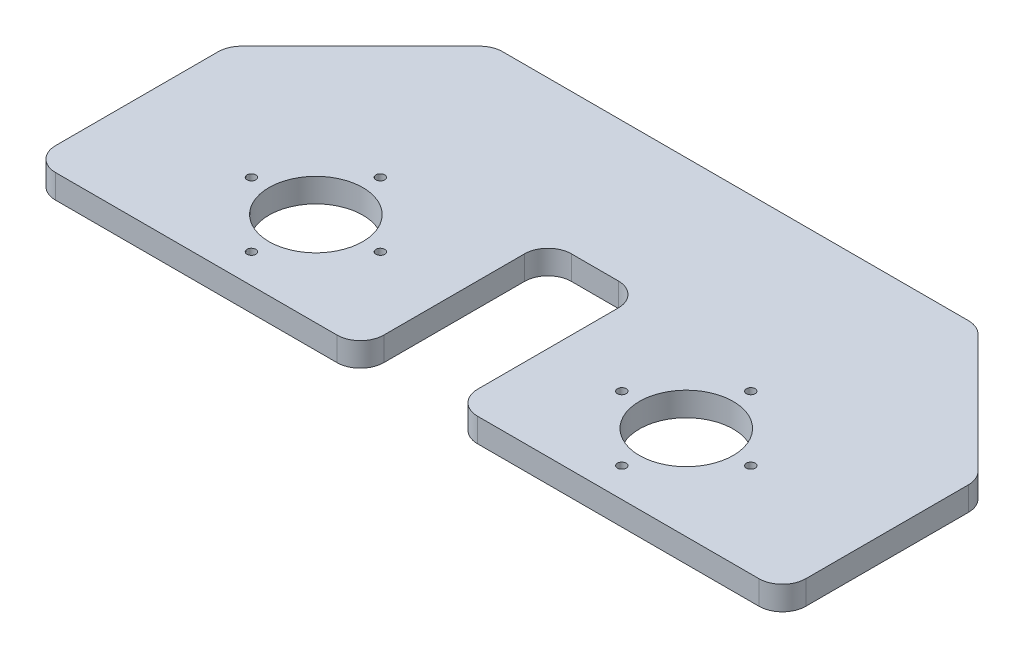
ISO-10303-21;
HEADER;
FILE_DESCRIPTION(('STEP AP214'),'2;1');
FILE_NAME('part.step','',(''),(''),'','','');
FILE_SCHEMA(('AUTOMOTIVE_DESIGN { 1 0 10303 214 1 1 1 1 }'));
ENDSEC;
DATA;
#1=APPLICATION_CONTEXT('core data for automotive mechanical design processes');
#2=APPLICATION_PROTOCOL_DEFINITION('international standard','automotive_design',2000,#1);
#3=PRODUCT_CONTEXT('',#1,'mechanical');
#4=PRODUCT('Part','Part','',(#3));
#5=PRODUCT_RELATED_PRODUCT_CATEGORY('part','',(#4));
#6=PRODUCT_DEFINITION_FORMATION('','',#4);
#7=PRODUCT_DEFINITION_CONTEXT('part definition',#1,'design');
#8=PRODUCT_DEFINITION('design','',#6,#7);
#9=PRODUCT_DEFINITION_SHAPE('','',#8);
#10=(LENGTH_UNIT() NAMED_UNIT(*) SI_UNIT(.MILLI.,.METRE.));
#11=(NAMED_UNIT(*) PLANE_ANGLE_UNIT() SI_UNIT($,.RADIAN.));
#12=(NAMED_UNIT(*) SI_UNIT($,.STERADIAN.) SOLID_ANGLE_UNIT());
#13=UNCERTAINTY_MEASURE_WITH_UNIT(LENGTH_MEASURE(1.E-05),#10,'distance_accuracy_value','');
#14=(GEOMETRIC_REPRESENTATION_CONTEXT(3) GLOBAL_UNCERTAINTY_ASSIGNED_CONTEXT((#13)) GLOBAL_UNIT_ASSIGNED_CONTEXT((#10,
#11,#12)) REPRESENTATION_CONTEXT('',''));
#15=CARTESIAN_POINT('',(0.,0.,0.));
#16=DIRECTION('',(0.,0.,1.));
#17=DIRECTION('',(1.,0.,0.));
#18=AXIS2_PLACEMENT_3D('',#15,#16,#17);
#19=CARTESIAN_POINT('',(-203.2,-12.954,50.8));
#20=DIRECTION('',(-1.,0.,0.));
#21=DIRECTION('',(0.,0.,1.));
#22=AXIS2_PLACEMENT_3D('',#19,#20,#21);
#23=PLANE('',#22);
#24=DIRECTION('',(0.,0.,1.));
#25=VECTOR('',#24,1.);
#26=CARTESIAN_POINT('',(-203.2,0.,50.8));
#27=LINE('',#26,#25);
#28=CARTESIAN_POINT('',(-203.2,0.,-49.8974387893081));
#29=VERTEX_POINT('',#28);
#30=CARTESIAN_POINT('',(-203.2,0.,38.1));
#31=VERTEX_POINT('',#30);
#32=EDGE_CURVE('E332',#29,#31,#27,.T.);
#33=ORIENTED_EDGE('',*,*,#32,.F.);
#34=DIRECTION('',(0.,1.,0.));
#35=VECTOR('',#34,1.);
#36=CARTESIAN_POINT('',(-203.2,-12.954,-49.8974387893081));
#37=LINE('',#36,#35);
#38=CARTESIAN_POINT('',(-203.2,-12.954,-49.8974387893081));
#39=VERTEX_POINT('',#38);
#40=EDGE_CURVE('E283',#29,#39,#37,.F.);
#41=ORIENTED_EDGE('',*,*,#40,.T.);
#42=DIRECTION('',(0.,0.,1.));
#43=VECTOR('',#42,1.);
#44=CARTESIAN_POINT('',(-203.2,-12.954,50.8));
#45=LINE('',#44,#43);
#46=CARTESIAN_POINT('',(-203.2,-12.954,38.1));
#47=VERTEX_POINT('',#46);
#48=EDGE_CURVE('E349',#39,#47,#45,.T.);
#49=ORIENTED_EDGE('',*,*,#48,.T.);
#50=DIRECTION('',(0.,1.,0.));
#51=VECTOR('',#50,1.);
#52=CARTESIAN_POINT('',(-203.2,-12.954,38.1));
#53=LINE('',#52,#51);
#54=EDGE_CURVE('E280',#47,#31,#53,.T.);
#55=ORIENTED_EDGE('',*,*,#54,.T.);
#56=EDGE_LOOP('',(#33,#41,#49,#55));
#57=FACE_BOUND('',#56,.T.);
#58=ADVANCED_FACE('F44',(#57),#23,.T.);
#59=CARTESIAN_POINT('',(-131.357951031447,-12.954,-127.));
#60=DIRECTION('',(-0.707106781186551,0.,-0.707106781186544));
#61=DIRECTION('',(-0.707106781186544,0.,0.707106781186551));
#62=AXIS2_PLACEMENT_3D('',#59,#60,#61);
#63=PLANE('',#62);
#64=DIRECTION('',(-0.707106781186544,0.,0.707106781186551));
#65=VECTOR('',#64,1.);
#66=CARTESIAN_POINT('',(-131.357951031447,0.,-127.));
#67=LINE('',#66,#65);
#68=CARTESIAN_POINT('',(-135.077694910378,0.,-123.280256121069));
#69=VERTEX_POINT('',#68);
#70=CARTESIAN_POINT('',(-199.480256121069,0.,-58.8776949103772));
#71=VERTEX_POINT('',#70);
#72=EDGE_CURVE('E213',#69,#71,#67,.T.);
#73=ORIENTED_EDGE('',*,*,#72,.F.);
#74=DIRECTION('',(0.,1.,0.));
#75=VECTOR('',#74,1.);
#76=CARTESIAN_POINT('',(-135.077694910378,-12.954,-123.280256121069));
#77=LINE('',#76,#75);
#78=CARTESIAN_POINT('',(-135.077694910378,-12.954,-123.280256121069));
#79=VERTEX_POINT('',#78);
#80=EDGE_CURVE('E278',#69,#79,#77,.F.);
#81=ORIENTED_EDGE('',*,*,#80,.T.);
#82=DIRECTION('',(-0.707106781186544,0.,0.707106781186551));
#83=VECTOR('',#82,1.);
#84=CARTESIAN_POINT('',(-131.357951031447,-12.954,-127.));
#85=LINE('',#84,#83);
#86=CARTESIAN_POINT('',(-199.480256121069,-12.954,-58.8776949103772));
#87=VERTEX_POINT('',#86);
#88=EDGE_CURVE('E205',#79,#87,#85,.T.);
#89=ORIENTED_EDGE('',*,*,#88,.T.);
#90=DIRECTION('',(0.,1.,0.));
#91=VECTOR('',#90,1.);
#92=CARTESIAN_POINT('',(-199.480256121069,-12.954,-58.8776949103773));
#93=LINE('',#92,#91);
#94=EDGE_CURVE('E275',#87,#71,#93,.T.);
#95=ORIENTED_EDGE('',*,*,#94,.T.);
#96=EDGE_LOOP('',(#73,#81,#89,#95));
#97=FACE_BOUND('',#96,.T.);
#98=ADVANCED_FACE('F461',(#97),#63,.T.);
#99=CARTESIAN_POINT('',(-131.357951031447,-12.954,-127.));
#100=DIRECTION('',(0.,0.,-1.));
#101=DIRECTION('',(-1.,0.,0.));
#102=AXIS2_PLACEMENT_3D('',#99,#100,#101);
#103=PLANE('',#102);
#104=DIRECTION('',(-1.,0.,0.));
#105=VECTOR('',#104,1.);
#106=CARTESIAN_POINT('',(-131.357951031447,0.,-127.));
#107=LINE('',#106,#105);
#108=CARTESIAN_POINT('',(126.097438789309,0.,-127.));
#109=VERTEX_POINT('',#108);
#110=CARTESIAN_POINT('',(-126.097438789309,0.,-127.));
#111=VERTEX_POINT('',#110);
#112=EDGE_CURVE('E345',#109,#111,#107,.T.);
#113=ORIENTED_EDGE('',*,*,#112,.F.);
#114=DIRECTION('',(0.,1.,0.));
#115=VECTOR('',#114,1.);
#116=CARTESIAN_POINT('',(126.097438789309,-12.954,-127.));
#117=LINE('',#116,#115);
#118=CARTESIAN_POINT('',(126.097438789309,-12.954,-127.));
#119=VERTEX_POINT('',#118);
#120=EDGE_CURVE('E273',#109,#119,#117,.F.);
#121=ORIENTED_EDGE('',*,*,#120,.T.);
#122=DIRECTION('',(-1.,0.,0.));
#123=VECTOR('',#122,1.);
#124=CARTESIAN_POINT('',(-131.357951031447,-12.954,-127.));
#125=LINE('',#124,#123);
#126=CARTESIAN_POINT('',(-126.097438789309,-12.954,-127.));
#127=VERTEX_POINT('',#126);
#128=EDGE_CURVE('E210',#119,#127,#125,.T.);
#129=ORIENTED_EDGE('',*,*,#128,.T.);
#130=DIRECTION('',(0.,1.,0.));
#131=VECTOR('',#130,1.);
#132=CARTESIAN_POINT('',(-126.097438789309,-12.954,-127.));
#133=LINE('',#132,#131);
#134=EDGE_CURVE('E270',#127,#111,#133,.T.);
#135=ORIENTED_EDGE('',*,*,#134,.T.);
#136=EDGE_LOOP('',(#113,#121,#129,#135));
#137=FACE_BOUND('',#136,.T.);
#138=ADVANCED_FACE('F466',(#137),#103,.T.);
#139=CARTESIAN_POINT('',(131.357951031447,-12.954,-127.));
#140=DIRECTION('',(0.707106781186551,0.,-0.707106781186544));
#141=DIRECTION('',(-0.707106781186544,0.,-0.707106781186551));
#142=AXIS2_PLACEMENT_3D('',#139,#140,#141);
#143=PLANE('',#142);
#144=DIRECTION('',(-0.707106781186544,0.,-0.707106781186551));
#145=VECTOR('',#144,1.);
#146=CARTESIAN_POINT('',(131.357951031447,0.,-127.));
#147=LINE('',#146,#145);
#148=CARTESIAN_POINT('',(199.480256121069,0.,-58.8776949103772));
#149=VERTEX_POINT('',#148);
#150=CARTESIAN_POINT('',(135.077694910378,0.,-123.280256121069));
#151=VERTEX_POINT('',#150);
#152=EDGE_CURVE('E343',#149,#151,#147,.T.);
#153=ORIENTED_EDGE('',*,*,#152,.F.);
#154=DIRECTION('',(0.,1.,0.));
#155=VECTOR('',#154,1.);
#156=CARTESIAN_POINT('',(199.480256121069,-12.954,-58.8776949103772));
#157=LINE('',#156,#155);
#158=CARTESIAN_POINT('',(199.480256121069,-12.954,-58.8776949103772));
#159=VERTEX_POINT('',#158);
#160=EDGE_CURVE('E268',#149,#159,#157,.F.);
#161=ORIENTED_EDGE('',*,*,#160,.T.);
#162=DIRECTION('',(-0.707106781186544,0.,-0.707106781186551));
#163=VECTOR('',#162,1.);
#164=CARTESIAN_POINT('',(131.357951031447,-12.954,-127.));
#165=LINE('',#164,#163);
#166=CARTESIAN_POINT('',(135.077694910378,-12.954,-123.280256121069));
#167=VERTEX_POINT('',#166);
#168=EDGE_CURVE('E327',#159,#167,#165,.T.);
#169=ORIENTED_EDGE('',*,*,#168,.T.);
#170=DIRECTION('',(0.,1.,0.));
#171=VECTOR('',#170,1.);
#172=CARTESIAN_POINT('',(135.077694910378,-12.954,-123.280256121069));
#173=LINE('',#172,#171);
#174=EDGE_CURVE('E265',#167,#151,#173,.T.);
#175=ORIENTED_EDGE('',*,*,#174,.T.);
#176=EDGE_LOOP('',(#153,#161,#169,#175));
#177=FACE_BOUND('',#176,.T.);
#178=ADVANCED_FACE('F524',(#177),#143,.T.);
#179=CARTESIAN_POINT('',(203.2,-12.954,50.8));
#180=DIRECTION('',(1.,0.,0.));
#181=DIRECTION('',(0.,0.,-1.));
#182=AXIS2_PLACEMENT_3D('',#179,#180,#181);
#183=PLANE('',#182);
#184=DIRECTION('',(0.,0.,-1.));
#185=VECTOR('',#184,1.);
#186=CARTESIAN_POINT('',(203.2,0.,50.8));
#187=LINE('',#186,#185);
#188=CARTESIAN_POINT('',(203.2,0.,38.1));
#189=VERTEX_POINT('',#188);
#190=CARTESIAN_POINT('',(203.2,0.,-49.8974387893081));
#191=VERTEX_POINT('',#190);
#192=EDGE_CURVE('E340',#189,#191,#187,.T.);
#193=ORIENTED_EDGE('',*,*,#192,.F.);
#194=DIRECTION('',(0.,1.,0.));
#195=VECTOR('',#194,1.);
#196=CARTESIAN_POINT('',(203.2,-12.954,38.1));
#197=LINE('',#196,#195);
#198=CARTESIAN_POINT('',(203.2,-12.954,38.1));
#199=VERTEX_POINT('',#198);
#200=EDGE_CURVE('E263',#189,#199,#197,.F.);
#201=ORIENTED_EDGE('',*,*,#200,.T.);
#202=DIRECTION('',(0.,0.,-1.));
#203=VECTOR('',#202,1.);
#204=CARTESIAN_POINT('',(203.2,-12.954,50.8));
#205=LINE('',#204,#203);
#206=CARTESIAN_POINT('',(203.2,-12.954,-49.8974387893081));
#207=VERTEX_POINT('',#206);
#208=EDGE_CURVE('E324',#199,#207,#205,.T.);
#209=ORIENTED_EDGE('',*,*,#208,.T.);
#210=DIRECTION('',(0.,1.,0.));
#211=VECTOR('',#210,1.);
#212=CARTESIAN_POINT('',(203.2,-12.954,-49.8974387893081));
#213=LINE('',#212,#211);
#214=EDGE_CURVE('E260',#207,#191,#213,.T.);
#215=ORIENTED_EDGE('',*,*,#214,.T.);
#216=EDGE_LOOP('',(#193,#201,#209,#215));
#217=FACE_BOUND('',#216,.T.);
#218=ADVANCED_FACE('F531',(#217),#183,.T.);
#219=CARTESIAN_POINT('',(25.4,-12.954,50.8));
#220=DIRECTION('',(0.,0.,1.));
#221=DIRECTION('',(1.,0.,0.));
#222=AXIS2_PLACEMENT_3D('',#219,#220,#221);
#223=PLANE('',#222);
#224=DIRECTION('',(1.,0.,0.));
#225=VECTOR('',#224,1.);
#226=CARTESIAN_POINT('',(25.4,0.,50.8));
#227=LINE('',#226,#225);
#228=CARTESIAN_POINT('',(38.1,0.,50.8));
#229=VERTEX_POINT('',#228);
#230=CARTESIAN_POINT('',(190.5,0.,50.8));
#231=VERTEX_POINT('',#230);
#232=EDGE_CURVE('E300',#229,#231,#227,.T.);
#233=ORIENTED_EDGE('',*,*,#232,.F.);
#234=DIRECTION('',(0.,1.,0.));
#235=VECTOR('',#234,1.);
#236=CARTESIAN_POINT('',(38.1,-12.954,50.8));
#237=LINE('',#236,#235);
#238=CARTESIAN_POINT('',(38.1,-12.954,50.8));
#239=VERTEX_POINT('',#238);
#240=EDGE_CURVE('E240',#229,#239,#237,.F.);
#241=ORIENTED_EDGE('',*,*,#240,.T.);
#242=DIRECTION('',(1.,0.,0.));
#243=VECTOR('',#242,1.);
#244=CARTESIAN_POINT('',(25.4,-12.954,50.8));
#245=LINE('',#244,#243);
#246=CARTESIAN_POINT('',(190.5,-12.954,50.8));
#247=VERTEX_POINT('',#246);
#248=EDGE_CURVE('E316',#239,#247,#245,.T.);
#249=ORIENTED_EDGE('',*,*,#248,.T.);
#250=DIRECTION('',(0.,1.,0.));
#251=VECTOR('',#250,1.);
#252=CARTESIAN_POINT('',(190.5,-12.954,50.8));
#253=LINE('',#252,#251);
#254=EDGE_CURVE('E237',#247,#231,#253,.T.);
#255=ORIENTED_EDGE('',*,*,#254,.T.);
#256=EDGE_LOOP('',(#233,#241,#249,#255));
#257=FACE_BOUND('',#256,.T.);
#258=ADVANCED_FACE('F537',(#257),#223,.T.);
#259=CARTESIAN_POINT('',(25.4,-12.954,50.8));
#260=DIRECTION('',(-1.,0.,0.));
#261=DIRECTION('',(0.,0.,1.));
#262=AXIS2_PLACEMENT_3D('',#259,#260,#261);
#263=PLANE('',#262);
#264=DIRECTION('',(0.,0.,1.));
#265=VECTOR('',#264,1.);
#266=CARTESIAN_POINT('',(25.4,0.,50.8));
#267=LINE('',#266,#265);
#268=CARTESIAN_POINT('',(25.4,0.,-38.1));
#269=VERTEX_POINT('',#268);
#270=CARTESIAN_POINT('',(25.4,0.,38.1));
#271=VERTEX_POINT('',#270);
#272=EDGE_CURVE('E290',#269,#271,#267,.T.);
#273=ORIENTED_EDGE('',*,*,#272,.F.);
#274=DIRECTION('',(0.,1.,0.));
#275=VECTOR('',#274,1.);
#276=CARTESIAN_POINT('',(25.4,-12.954,-38.1));
#277=LINE('',#276,#275);
#278=CARTESIAN_POINT('',(25.4,-12.954,-38.1));
#279=VERTEX_POINT('',#278);
#280=EDGE_CURVE('E223',#269,#279,#277,.F.);
#281=ORIENTED_EDGE('',*,*,#280,.T.);
#282=DIRECTION('',(0.,0.,1.));
#283=VECTOR('',#282,1.);
#284=CARTESIAN_POINT('',(25.4,-12.954,50.8));
#285=LINE('',#284,#283);
#286=CARTESIAN_POINT('',(25.4,-12.954,38.1));
#287=VERTEX_POINT('',#286);
#288=EDGE_CURVE('E310',#279,#287,#285,.T.);
#289=ORIENTED_EDGE('',*,*,#288,.T.);
#290=DIRECTION('',(0.,1.,0.));
#291=VECTOR('',#290,1.);
#292=CARTESIAN_POINT('',(25.4,-12.954,38.1));
#293=LINE('',#292,#291);
#294=EDGE_CURVE('E220',#287,#271,#293,.T.);
#295=ORIENTED_EDGE('',*,*,#294,.T.);
#296=EDGE_LOOP('',(#273,#281,#289,#295));
#297=FACE_BOUND('',#296,.T.);
#298=ADVANCED_FACE('F296',(#297),#263,.T.);
#299=CARTESIAN_POINT('',(-25.4,-12.954,-50.8));
#300=DIRECTION('',(0.,0.,1.));
#301=DIRECTION('',(1.,0.,0.));
#302=AXIS2_PLACEMENT_3D('',#299,#300,#301);
#303=PLANE('',#302);
#304=DIRECTION('',(1.,0.,0.));
#305=VECTOR('',#304,1.);
#306=CARTESIAN_POINT('',(-25.4,0.,-50.8));
#307=LINE('',#306,#305);
#308=CARTESIAN_POINT('',(-12.7,0.,-50.8));
#309=VERTEX_POINT('',#308);
#310=CARTESIAN_POINT('',(12.7,0.,-50.8));
#311=VERTEX_POINT('',#310);
#312=EDGE_CURVE('E202',#309,#311,#307,.T.);
#313=ORIENTED_EDGE('',*,*,#312,.F.);
#314=DIRECTION('',(0.,1.,0.));
#315=VECTOR('',#314,1.);
#316=CARTESIAN_POINT('',(-12.7,-12.954,-50.8));
#317=LINE('',#316,#315);
#318=CARTESIAN_POINT('',(-12.7,-12.954,-50.8));
#319=VERTEX_POINT('',#318);
#320=EDGE_CURVE('E218',#309,#319,#317,.F.);
#321=ORIENTED_EDGE('',*,*,#320,.T.);
#322=DIRECTION('',(1.,0.,0.));
#323=VECTOR('',#322,1.);
#324=CARTESIAN_POINT('',(-25.4,-12.954,-50.8));
#325=LINE('',#324,#323);
#326=CARTESIAN_POINT('',(12.7,-12.954,-50.8));
#327=VERTEX_POINT('',#326);
#328=EDGE_CURVE('E308',#319,#327,#325,.T.);
#329=ORIENTED_EDGE('',*,*,#328,.T.);
#330=DIRECTION('',(0.,1.,0.));
#331=VECTOR('',#330,1.);
#332=CARTESIAN_POINT('',(12.7,0.,-50.8));
#333=LINE('',#332,#331);
#334=EDGE_CURVE('E207',#327,#311,#333,.T.);
#335=ORIENTED_EDGE('',*,*,#334,.T.);
#336=EDGE_LOOP('',(#313,#321,#329,#335));
#337=FACE_BOUND('',#336,.T.);
#338=ADVANCED_FACE('F312',(#337),#303,.T.);
#339=CARTESIAN_POINT('',(-25.4,-12.954,50.8));
#340=DIRECTION('',(1.,0.,0.));
#341=DIRECTION('',(0.,0.,-1.));
#342=AXIS2_PLACEMENT_3D('',#339,#340,#341);
#343=PLANE('',#342);
#344=DIRECTION('',(0.,0.,-1.));
#345=VECTOR('',#344,1.);
#346=CARTESIAN_POINT('',(-25.4,-12.954,50.8));
#347=LINE('',#346,#345);
#348=CARTESIAN_POINT('',(-25.4,-12.954,38.1));
#349=VERTEX_POINT('',#348);
#350=CARTESIAN_POINT('',(-25.4,-12.954,-38.1));
#351=VERTEX_POINT('',#350);
#352=EDGE_CURVE('E314',#349,#351,#347,.T.);
#353=ORIENTED_EDGE('',*,*,#352,.T.);
#354=DIRECTION('',(0.,1.,0.));
#355=VECTOR('',#354,1.);
#356=CARTESIAN_POINT('',(-25.4,0.,-38.1));
#357=LINE('',#356,#355);
#358=CARTESIAN_POINT('',(-25.4,0.,-38.1));
#359=VERTEX_POINT('',#358);
#360=EDGE_CURVE('E201',#351,#359,#357,.T.);
#361=ORIENTED_EDGE('',*,*,#360,.T.);
#362=DIRECTION('',(0.,0.,-1.));
#363=VECTOR('',#362,1.);
#364=CARTESIAN_POINT('',(-25.4,0.,50.8));
#365=LINE('',#364,#363);
#366=CARTESIAN_POINT('',(-25.4,0.,38.1));
#367=VERTEX_POINT('',#366);
#368=EDGE_CURVE('E186',#367,#359,#365,.T.);
#369=ORIENTED_EDGE('',*,*,#368,.F.);
#370=DIRECTION('',(0.,1.,0.));
#371=VECTOR('',#370,1.);
#372=CARTESIAN_POINT('',(-25.4,-12.954,38.1));
#373=LINE('',#372,#371);
#374=EDGE_CURVE('E199',#367,#349,#373,.F.);
#375=ORIENTED_EDGE('',*,*,#374,.T.);
#376=EDGE_LOOP('',(#353,#361,#369,#375));
#377=FACE_BOUND('',#376,.T.);
#378=ADVANCED_FACE('F198',(#377),#343,.T.);
#379=CARTESIAN_POINT('',(-203.2,-12.954,50.8));
#380=DIRECTION('',(0.,0.,1.));
#381=DIRECTION('',(1.,0.,0.));
#382=AXIS2_PLACEMENT_3D('',#379,#380,#381);
#383=PLANE('',#382);
#384=DIRECTION('',(1.,0.,0.));
#385=VECTOR('',#384,1.);
#386=CARTESIAN_POINT('',(-203.2,-12.954,50.8));
#387=LINE('',#386,#385);
#388=CARTESIAN_POINT('',(-190.5,-12.954,50.8));
#389=VERTEX_POINT('',#388);
#390=CARTESIAN_POINT('',(-38.1,-12.954,50.8));
#391=VERTEX_POINT('',#390);
#392=EDGE_CURVE('E318',#389,#391,#387,.T.);
#393=ORIENTED_EDGE('',*,*,#392,.T.);
#394=DIRECTION('',(0.,1.,0.));
#395=VECTOR('',#394,1.);
#396=CARTESIAN_POINT('',(-38.1,-12.954,50.8));
#397=LINE('',#396,#395);
#398=CARTESIAN_POINT('',(-38.1,0.,50.8));
#399=VERTEX_POINT('',#398);
#400=EDGE_CURVE('E258',#391,#399,#397,.T.);
#401=ORIENTED_EDGE('',*,*,#400,.T.);
#402=DIRECTION('',(1.,0.,0.));
#403=VECTOR('',#402,1.);
#404=CARTESIAN_POINT('',(-203.2,0.,50.8));
#405=LINE('',#404,#403);
#406=CARTESIAN_POINT('',(-190.5,0.,50.8));
#407=VERTEX_POINT('',#406);
#408=EDGE_CURVE('E187',#407,#399,#405,.T.);
#409=ORIENTED_EDGE('',*,*,#408,.F.);
#410=DIRECTION('',(0.,1.,0.));
#411=VECTOR('',#410,1.);
#412=CARTESIAN_POINT('',(-190.5,-12.954,50.8));
#413=LINE('',#412,#411);
#414=EDGE_CURVE('E66',#407,#389,#413,.F.);
#415=ORIENTED_EDGE('',*,*,#414,.T.);
#416=EDGE_LOOP('',(#393,#401,#409,#415));
#417=FACE_BOUND('',#416,.T.);
#418=ADVANCED_FACE('F472',(#417),#383,.T.);
#419=CARTESIAN_POINT('',(0.,-12.954,0.));
#420=DIRECTION('',(0.,-1.,0.));
#421=DIRECTION('',(0.,0.,-1.));
#422=AXIS2_PLACEMENT_3D('',#419,#420,#421);
#423=PLANE('',#422);
#424=CARTESIAN_POINT('',(100.33,-12.954,0.));
#425=DIRECTION('',(0.,1.,0.));
#426=DIRECTION('',(0.,0.,1.));
#427=AXIS2_PLACEMENT_3D('',#424,#425,#426);
#428=CIRCLE('',#427,25.4);
#429=CARTESIAN_POINT('',(100.33,-12.954,25.4));
#430=VERTEX_POINT('',#429);
#431=EDGE_CURVE('E360',#430,#430,#428,.T.);
#432=ORIENTED_EDGE('',*,*,#431,.T.);
#433=EDGE_LOOP('',(#432));
#434=FACE_BOUND('',#433,.T.);
#435=CARTESIAN_POINT('',(-100.33,-12.954,0.));
#436=DIRECTION('',(0.,1.,0.));
#437=DIRECTION('',(0.,0.,1.));
#438=AXIS2_PLACEMENT_3D('',#435,#436,#437);
#439=CIRCLE('',#438,25.4);
#440=CARTESIAN_POINT('',(-100.33,-12.954,25.4));
#441=VERTEX_POINT('',#440);
#442=EDGE_CURVE('E335',#441,#441,#439,.T.);
#443=ORIENTED_EDGE('',*,*,#442,.T.);
#444=EDGE_LOOP('',(#443));
#445=FACE_BOUND('',#444,.T.);
#446=ORIENTED_EDGE('',*,*,#248,.F.);
#447=CARTESIAN_POINT('',(38.1,-12.954,38.1));
#448=DIRECTION('',(0.,-1.,0.));
#449=DIRECTION('',(0.,0.,-1.));
#450=AXIS2_PLACEMENT_3D('',#447,#448,#449);
#451=CIRCLE('',#450,12.7);
#452=EDGE_CURVE('E255',#239,#287,#451,.T.);
#453=ORIENTED_EDGE('',*,*,#452,.T.);
#454=ORIENTED_EDGE('',*,*,#288,.F.);
#455=CARTESIAN_POINT('',(12.7,-12.954,-38.1));
#456=DIRECTION('',(0.,-1.,0.));
#457=DIRECTION('',(0.,0.,-1.));
#458=AXIS2_PLACEMENT_3D('',#455,#456,#457);
#459=CIRCLE('',#458,12.7);
#460=EDGE_CURVE('E13',#279,#327,#459,.F.);
#461=ORIENTED_EDGE('',*,*,#460,.T.);
#462=ORIENTED_EDGE('',*,*,#328,.F.);
#463=CARTESIAN_POINT('',(-12.7,-12.954,-38.1));
#464=DIRECTION('',(0.,-1.,0.));
#465=DIRECTION('',(0.,0.,-1.));
#466=AXIS2_PLACEMENT_3D('',#463,#464,#465);
#467=CIRCLE('',#466,12.7);
#468=EDGE_CURVE('E287',#319,#351,#467,.F.);
#469=ORIENTED_EDGE('',*,*,#468,.T.);
#470=ORIENTED_EDGE('',*,*,#352,.F.);
#471=CARTESIAN_POINT('',(-38.1,-12.954,38.1));
#472=DIRECTION('',(0.,-1.,0.));
#473=DIRECTION('',(0.,0.,-1.));
#474=AXIS2_PLACEMENT_3D('',#471,#472,#473);
#475=CIRCLE('',#474,12.7);
#476=EDGE_CURVE('E59',#349,#391,#475,.T.);
#477=ORIENTED_EDGE('',*,*,#476,.T.);
#478=ORIENTED_EDGE('',*,*,#392,.F.);
#479=CARTESIAN_POINT('',(-190.5,-12.954,38.1));
#480=DIRECTION('',(0.,-1.,0.));
#481=DIRECTION('',(0.,0.,-1.));
#482=AXIS2_PLACEMENT_3D('',#479,#480,#481);
#483=CIRCLE('',#482,12.7);
#484=EDGE_CURVE('E242',#389,#47,#483,.T.);
#485=ORIENTED_EDGE('',*,*,#484,.T.);
#486=ORIENTED_EDGE('',*,*,#48,.F.);
#487=CARTESIAN_POINT('',(-190.5,-12.954,-49.8974387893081));
#488=DIRECTION('',(0.,-1.,0.));
#489=DIRECTION('',(0.,0.,-1.));
#490=AXIS2_PLACEMENT_3D('',#487,#488,#489);
#491=CIRCLE('',#490,12.7);
#492=EDGE_CURVE('E244',#39,#87,#491,.T.);
#493=ORIENTED_EDGE('',*,*,#492,.T.);
#494=ORIENTED_EDGE('',*,*,#88,.F.);
#495=CARTESIAN_POINT('',(-126.097438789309,-12.954,-114.3));
#496=DIRECTION('',(0.,-1.,0.));
#497=DIRECTION('',(0.,0.,-1.));
#498=AXIS2_PLACEMENT_3D('',#495,#496,#497);
#499=CIRCLE('',#498,12.7);
#500=EDGE_CURVE('E246',#79,#127,#499,.T.);
#501=ORIENTED_EDGE('',*,*,#500,.T.);
#502=ORIENTED_EDGE('',*,*,#128,.F.);
#503=CARTESIAN_POINT('',(126.097438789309,-12.954,-114.3));
#504=DIRECTION('',(0.,-1.,0.));
#505=DIRECTION('',(0.,0.,-1.));
#506=AXIS2_PLACEMENT_3D('',#503,#504,#505);
#507=CIRCLE('',#506,12.7);
#508=EDGE_CURVE('E248',#119,#167,#507,.T.);
#509=ORIENTED_EDGE('',*,*,#508,.T.);
#510=ORIENTED_EDGE('',*,*,#168,.F.);
#511=CARTESIAN_POINT('',(190.5,-12.954,-49.8974387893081));
#512=DIRECTION('',(0.,-1.,0.));
#513=DIRECTION('',(0.,0.,-1.));
#514=AXIS2_PLACEMENT_3D('',#511,#512,#513);
#515=CIRCLE('',#514,12.7);
#516=EDGE_CURVE('E250',#159,#207,#515,.T.);
#517=ORIENTED_EDGE('',*,*,#516,.T.);
#518=ORIENTED_EDGE('',*,*,#208,.F.);
#519=CARTESIAN_POINT('',(190.5,-12.954,38.1));
#520=DIRECTION('',(0.,-1.,0.));
#521=DIRECTION('',(0.,0.,-1.));
#522=AXIS2_PLACEMENT_3D('',#519,#520,#521);
#523=CIRCLE('',#522,12.7);
#524=EDGE_CURVE('E252',#199,#247,#523,.T.);
#525=ORIENTED_EDGE('',*,*,#524,.T.);
#526=EDGE_LOOP('',(#446,#453,#454,#461,#462,#469,#470,#477,#478,#485,#486,#493,#494,#501,#502,
#509,#510,#517,#518,#525));
#527=FACE_BOUND('',#526,.T.);
#528=ADVANCED_FACE('F307',(#434,#445,#527),#423,.T.);
#529=CARTESIAN_POINT('',(0.,0.,0.));
#530=DIRECTION('',(0.,-1.,0.));
#531=DIRECTION('',(0.,0.,-1.));
#532=AXIS2_PLACEMENT_3D('',#529,#530,#531);
#533=PLANE('',#532);
#534=CARTESIAN_POINT('',(100.33,0.,34.925));
#535=DIRECTION('',(0.,1.,0.));
#536=DIRECTION('',(0.,0.,1.));
#537=AXIS2_PLACEMENT_3D('',#534,#535,#536);
#538=CIRCLE('',#537,2.37490000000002);
#539=CARTESIAN_POINT('',(100.33,0.,37.2999));
#540=VERTEX_POINT('',#539);
#541=EDGE_CURVE('E411',#540,#540,#538,.T.);
#542=ORIENTED_EDGE('',*,*,#541,.F.);
#543=EDGE_LOOP('',(#542));
#544=FACE_BOUND('',#543,.T.);
#545=CARTESIAN_POINT('',(135.255,0.,0.));
#546=DIRECTION('',(0.,1.,0.));
#547=DIRECTION('',(0.,0.,1.));
#548=AXIS2_PLACEMENT_3D('',#545,#546,#547);
#549=CIRCLE('',#548,2.37490000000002);
#550=CARTESIAN_POINT('',(135.255,0.,2.37490000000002));
#551=VERTEX_POINT('',#550);
#552=EDGE_CURVE('E405',#551,#551,#549,.T.);
#553=ORIENTED_EDGE('',*,*,#552,.F.);
#554=EDGE_LOOP('',(#553));
#555=FACE_BOUND('',#554,.T.);
#556=CARTESIAN_POINT('',(100.33,0.,-34.925));
#557=DIRECTION('',(0.,1.,0.));
#558=DIRECTION('',(0.,0.,1.));
#559=AXIS2_PLACEMENT_3D('',#556,#557,#558);
#560=CIRCLE('',#559,2.37490000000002);
#561=CARTESIAN_POINT('',(100.33,0.,-32.5501));
#562=VERTEX_POINT('',#561);
#563=EDGE_CURVE('E399',#562,#562,#560,.T.);
#564=ORIENTED_EDGE('',*,*,#563,.F.);
#565=EDGE_LOOP('',(#564));
#566=FACE_BOUND('',#565,.T.);
#567=CARTESIAN_POINT('',(65.405,0.,0.));
#568=DIRECTION('',(0.,1.,0.));
#569=DIRECTION('',(0.,0.,1.));
#570=AXIS2_PLACEMENT_3D('',#567,#568,#569);
#571=CIRCLE('',#570,2.37490000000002);
#572=CARTESIAN_POINT('',(65.405,0.,2.37490000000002));
#573=VERTEX_POINT('',#572);
#574=EDGE_CURVE('E393',#573,#573,#571,.T.);
#575=ORIENTED_EDGE('',*,*,#574,.F.);
#576=EDGE_LOOP('',(#575));
#577=FACE_BOUND('',#576,.T.);
#578=CARTESIAN_POINT('',(-135.255,0.,0.));
#579=DIRECTION('',(0.,1.,0.));
#580=DIRECTION('',(0.,0.,1.));
#581=AXIS2_PLACEMENT_3D('',#578,#579,#580);
#582=CIRCLE('',#581,2.37490000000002);
#583=CARTESIAN_POINT('',(-135.255,0.,2.37490000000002));
#584=VERTEX_POINT('',#583);
#585=EDGE_CURVE('E387',#584,#584,#582,.T.);
#586=ORIENTED_EDGE('',*,*,#585,.F.);
#587=EDGE_LOOP('',(#586));
#588=FACE_BOUND('',#587,.T.);
#589=CARTESIAN_POINT('',(-65.405,0.,0.));
#590=DIRECTION('',(0.,1.,0.));
#591=DIRECTION('',(0.,0.,1.));
#592=AXIS2_PLACEMENT_3D('',#589,#590,#591);
#593=CIRCLE('',#592,2.37490000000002);
#594=CARTESIAN_POINT('',(-65.405,0.,2.37490000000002));
#595=VERTEX_POINT('',#594);
#596=EDGE_CURVE('E381',#595,#595,#593,.T.);
#597=ORIENTED_EDGE('',*,*,#596,.F.);
#598=EDGE_LOOP('',(#597));
#599=FACE_BOUND('',#598,.T.);
#600=CARTESIAN_POINT('',(-100.33,0.,34.925));
#601=DIRECTION('',(0.,1.,0.));
#602=DIRECTION('',(0.,0.,1.));
#603=AXIS2_PLACEMENT_3D('',#600,#601,#602);
#604=CIRCLE('',#603,2.37490000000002);
#605=CARTESIAN_POINT('',(-100.33,0.,37.2999));
#606=VERTEX_POINT('',#605);
#607=EDGE_CURVE('E375',#606,#606,#604,.T.);
#608=ORIENTED_EDGE('',*,*,#607,.F.);
#609=EDGE_LOOP('',(#608));
#610=FACE_BOUND('',#609,.T.);
#611=CARTESIAN_POINT('',(-100.33,0.,-34.925));
#612=DIRECTION('',(0.,1.,0.));
#613=DIRECTION('',(0.,0.,1.));
#614=AXIS2_PLACEMENT_3D('',#611,#612,#613);
#615=CIRCLE('',#614,2.37490000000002);
#616=CARTESIAN_POINT('',(-100.33,0.,-32.5501));
#617=VERTEX_POINT('',#616);
#618=EDGE_CURVE('E369',#617,#617,#615,.T.);
#619=ORIENTED_EDGE('',*,*,#618,.F.);
#620=EDGE_LOOP('',(#619));
#621=FACE_BOUND('',#620,.T.);
#622=CARTESIAN_POINT('',(100.33,0.,0.));
#623=DIRECTION('',(0.,1.,0.));
#624=DIRECTION('',(0.,0.,1.));
#625=AXIS2_PLACEMENT_3D('',#622,#623,#624);
#626=CIRCLE('',#625,25.4);
#627=CARTESIAN_POINT('',(100.33,0.,25.4));
#628=VERTEX_POINT('',#627);
#629=EDGE_CURVE('E363',#628,#628,#626,.T.);
#630=ORIENTED_EDGE('',*,*,#629,.F.);
#631=EDGE_LOOP('',(#630));
#632=FACE_BOUND('',#631,.T.);
#633=CARTESIAN_POINT('',(-100.33,0.,0.));
#634=DIRECTION('',(0.,1.,0.));
#635=DIRECTION('',(0.,0.,1.));
#636=AXIS2_PLACEMENT_3D('',#633,#634,#635);
#637=CIRCLE('',#636,25.4);
#638=CARTESIAN_POINT('',(-100.33,0.,25.4));
#639=VERTEX_POINT('',#638);
#640=EDGE_CURVE('E357',#639,#639,#637,.T.);
#641=ORIENTED_EDGE('',*,*,#640,.F.);
#642=EDGE_LOOP('',(#641));
#643=FACE_BOUND('',#642,.T.);
#644=ORIENTED_EDGE('',*,*,#272,.T.);
#645=CARTESIAN_POINT('',(38.1,0.,38.1));
#646=DIRECTION('',(0.,-1.,0.));
#647=DIRECTION('',(0.,0.,-1.));
#648=AXIS2_PLACEMENT_3D('',#645,#646,#647);
#649=CIRCLE('',#648,12.7);
#650=EDGE_CURVE('E192',#271,#229,#649,.F.);
#651=ORIENTED_EDGE('',*,*,#650,.T.);
#652=ORIENTED_EDGE('',*,*,#232,.T.);
#653=CARTESIAN_POINT('',(190.5,0.,38.1));
#654=DIRECTION('',(0.,-1.,0.));
#655=DIRECTION('',(0.,0.,-1.));
#656=AXIS2_PLACEMENT_3D('',#653,#654,#655);
#657=CIRCLE('',#656,12.7);
#658=EDGE_CURVE('E193',#231,#189,#657,.F.);
#659=ORIENTED_EDGE('',*,*,#658,.T.);
#660=ORIENTED_EDGE('',*,*,#192,.T.);
#661=CARTESIAN_POINT('',(190.5,0.,-49.8974387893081));
#662=DIRECTION('',(0.,-1.,0.));
#663=DIRECTION('',(0.,0.,-1.));
#664=AXIS2_PLACEMENT_3D('',#661,#662,#663);
#665=CIRCLE('',#664,12.7);
#666=EDGE_CURVE('E233',#191,#149,#665,.F.);
#667=ORIENTED_EDGE('',*,*,#666,.T.);
#668=ORIENTED_EDGE('',*,*,#152,.T.);
#669=CARTESIAN_POINT('',(126.097438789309,0.,-114.3));
#670=DIRECTION('',(0.,-1.,0.));
#671=DIRECTION('',(0.,0.,-1.));
#672=AXIS2_PLACEMENT_3D('',#669,#670,#671);
#673=CIRCLE('',#672,12.7);
#674=EDGE_CURVE('E231',#151,#109,#673,.F.);
#675=ORIENTED_EDGE('',*,*,#674,.T.);
#676=ORIENTED_EDGE('',*,*,#112,.T.);
#677=CARTESIAN_POINT('',(-126.097438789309,0.,-114.3));
#678=DIRECTION('',(0.,-1.,0.));
#679=DIRECTION('',(0.,0.,-1.));
#680=AXIS2_PLACEMENT_3D('',#677,#678,#679);
#681=CIRCLE('',#680,12.7);
#682=EDGE_CURVE('E229',#111,#69,#681,.F.);
#683=ORIENTED_EDGE('',*,*,#682,.T.);
#684=ORIENTED_EDGE('',*,*,#72,.T.);
#685=CARTESIAN_POINT('',(-190.5,0.,-49.8974387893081));
#686=DIRECTION('',(0.,-1.,0.));
#687=DIRECTION('',(0.,0.,-1.));
#688=AXIS2_PLACEMENT_3D('',#685,#686,#687);
#689=CIRCLE('',#688,12.7);
#690=EDGE_CURVE('E227',#71,#29,#689,.F.);
#691=ORIENTED_EDGE('',*,*,#690,.T.);
#692=ORIENTED_EDGE('',*,*,#32,.T.);
#693=CARTESIAN_POINT('',(-190.5,0.,38.1));
#694=DIRECTION('',(0.,-1.,0.));
#695=DIRECTION('',(0.,0.,-1.));
#696=AXIS2_PLACEMENT_3D('',#693,#694,#695);
#697=CIRCLE('',#696,12.7);
#698=EDGE_CURVE('E225',#31,#407,#697,.F.);
#699=ORIENTED_EDGE('',*,*,#698,.T.);
#700=ORIENTED_EDGE('',*,*,#408,.T.);
#701=CARTESIAN_POINT('',(-38.1,0.,38.1));
#702=DIRECTION('',(0.,-1.,0.));
#703=DIRECTION('',(0.,0.,-1.));
#704=AXIS2_PLACEMENT_3D('',#701,#702,#703);
#705=CIRCLE('',#704,12.7);
#706=EDGE_CURVE('E182',#399,#367,#705,.F.);
#707=ORIENTED_EDGE('',*,*,#706,.T.);
#708=ORIENTED_EDGE('',*,*,#368,.T.);
#709=CARTESIAN_POINT('',(-12.7,0.,-38.1));
#710=DIRECTION('',(0.,-1.,0.));
#711=DIRECTION('',(0.,0.,-1.));
#712=AXIS2_PLACEMENT_3D('',#709,#710,#711);
#713=CIRCLE('',#712,12.7);
#714=EDGE_CURVE('E285',#359,#309,#713,.T.);
#715=ORIENTED_EDGE('',*,*,#714,.T.);
#716=ORIENTED_EDGE('',*,*,#312,.T.);
#717=CARTESIAN_POINT('',(12.7,0.,-38.1));
#718=DIRECTION('',(0.,-1.,0.));
#719=DIRECTION('',(0.,0.,-1.));
#720=AXIS2_PLACEMENT_3D('',#717,#718,#719);
#721=CIRCLE('',#720,12.7);
#722=EDGE_CURVE('E52',#311,#269,#721,.T.);
#723=ORIENTED_EDGE('',*,*,#722,.T.);
#724=EDGE_LOOP('',(#644,#651,#652,#659,#660,#667,#668,#675,#676,#683,#684,#691,#692,#699,#700,
#707,#708,#715,#716,#723));
#725=FACE_BOUND('',#724,.T.);
#726=ADVANCED_FACE('F185',(#544,#555,#566,#577,#588,#599,#610,#621,#632,#643,#725),#533,.F.);
#727=CARTESIAN_POINT('',(-100.33,-12.954,0.));
#728=DIRECTION('',(0.,1.,0.));
#729=DIRECTION('',(0.,0.,1.));
#730=AXIS2_PLACEMENT_3D('',#727,#728,#729);
#731=CYLINDRICAL_SURFACE('',#730,25.4);
#732=ORIENTED_EDGE('',*,*,#442,.F.);
#733=EDGE_LOOP('',(#732));
#734=FACE_BOUND('',#733,.T.);
#735=ORIENTED_EDGE('',*,*,#640,.T.);
#736=EDGE_LOOP('',(#735));
#737=FACE_BOUND('',#736,.T.);
#738=ADVANCED_FACE('F428',(#734,#737),#731,.F.);
#739=CARTESIAN_POINT('',(100.33,-12.954,0.));
#740=DIRECTION('',(0.,1.,0.));
#741=DIRECTION('',(0.,0.,1.));
#742=AXIS2_PLACEMENT_3D('',#739,#740,#741);
#743=CYLINDRICAL_SURFACE('',#742,25.4);
#744=ORIENTED_EDGE('',*,*,#431,.F.);
#745=EDGE_LOOP('',(#744));
#746=FACE_BOUND('',#745,.T.);
#747=ORIENTED_EDGE('',*,*,#629,.T.);
#748=EDGE_LOOP('',(#747));
#749=FACE_BOUND('',#748,.T.);
#750=ADVANCED_FACE('F449',(#746,#749),#743,.F.);
#751=CARTESIAN_POINT('',(-100.33,-6.35,-34.925));
#752=DIRECTION('',(0.,1.,0.));
#753=DIRECTION('',(0.,0.,1.));
#754=AXIS2_PLACEMENT_3D('',#751,#752,#753);
#755=CYLINDRICAL_SURFACE('',#754,2.37490000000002);
#756=CARTESIAN_POINT('',(-100.33,-6.35,-34.925));
#757=DIRECTION('',(0.,1.,0.));
#758=DIRECTION('',(0.,0.,1.));
#759=AXIS2_PLACEMENT_3D('',#756,#757,#758);
#760=CIRCLE('',#759,2.37490000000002);
#761=CARTESIAN_POINT('',(-100.33,-6.35,-32.5501));
#762=VERTEX_POINT('',#761);
#763=EDGE_CURVE('E366',#762,#762,#760,.T.);
#764=ORIENTED_EDGE('',*,*,#763,.F.);
#765=EDGE_LOOP('',(#764));
#766=FACE_BOUND('',#765,.T.);
#767=ORIENTED_EDGE('',*,*,#618,.T.);
#768=EDGE_LOOP('',(#767));
#769=FACE_BOUND('',#768,.T.);
#770=ADVANCED_FACE('F455',(#766,#769),#755,.F.);
#771=CARTESIAN_POINT('',(-100.33,-6.35,-34.925));
#772=DIRECTION('',(0.,1.,0.));
#773=DIRECTION('',(0.,0.,1.));
#774=AXIS2_PLACEMENT_3D('',#771,#772,#773);
#775=PLANE('',#774);
#776=ORIENTED_EDGE('',*,*,#763,.T.);
#777=EDGE_LOOP('',(#776));
#778=FACE_BOUND('',#777,.T.);
#779=ADVANCED_FACE('F772',(#778),#775,.T.);
#780=CARTESIAN_POINT('',(-100.33,-6.35,34.925));
#781=DIRECTION('',(0.,1.,0.));
#782=DIRECTION('',(0.,0.,1.));
#783=AXIS2_PLACEMENT_3D('',#780,#781,#782);
#784=CYLINDRICAL_SURFACE('',#783,2.37490000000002);
#785=CARTESIAN_POINT('',(-100.33,-6.35,34.925));
#786=DIRECTION('',(0.,1.,0.));
#787=DIRECTION('',(0.,0.,1.));
#788=AXIS2_PLACEMENT_3D('',#785,#786,#787);
#789=CIRCLE('',#788,2.37490000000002);
#790=CARTESIAN_POINT('',(-100.33,-6.35,37.2999));
#791=VERTEX_POINT('',#790);
#792=EDGE_CURVE('E372',#791,#791,#789,.T.);
#793=ORIENTED_EDGE('',*,*,#792,.F.);
#794=EDGE_LOOP('',(#793));
#795=FACE_BOUND('',#794,.T.);
#796=ORIENTED_EDGE('',*,*,#607,.T.);
#797=EDGE_LOOP('',(#796));
#798=FACE_BOUND('',#797,.T.);
#799=ADVANCED_FACE('F764',(#795,#798),#784,.F.);
#800=CARTESIAN_POINT('',(-100.33,-6.35,34.925));
#801=DIRECTION('',(0.,1.,0.));
#802=DIRECTION('',(0.,0.,1.));
#803=AXIS2_PLACEMENT_3D('',#800,#801,#802);
#804=PLANE('',#803);
#805=ORIENTED_EDGE('',*,*,#792,.T.);
#806=EDGE_LOOP('',(#805));
#807=FACE_BOUND('',#806,.T.);
#808=ADVANCED_FACE('F756',(#807),#804,.T.);
#809=CARTESIAN_POINT('',(-65.405,-6.35,0.));
#810=DIRECTION('',(0.,1.,0.));
#811=DIRECTION('',(0.,0.,1.));
#812=AXIS2_PLACEMENT_3D('',#809,#810,#811);
#813=CYLINDRICAL_SURFACE('',#812,2.37490000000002);
#814=CARTESIAN_POINT('',(-65.405,-6.35,0.));
#815=DIRECTION('',(0.,1.,0.));
#816=DIRECTION('',(0.,0.,1.));
#817=AXIS2_PLACEMENT_3D('',#814,#815,#816);
#818=CIRCLE('',#817,2.37490000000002);
#819=CARTESIAN_POINT('',(-65.405,-6.35,2.37490000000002));
#820=VERTEX_POINT('',#819);
#821=EDGE_CURVE('E378',#820,#820,#818,.T.);
#822=ORIENTED_EDGE('',*,*,#821,.F.);
#823=EDGE_LOOP('',(#822));
#824=FACE_BOUND('',#823,.T.);
#825=ORIENTED_EDGE('',*,*,#596,.T.);
#826=EDGE_LOOP('',(#825));
#827=FACE_BOUND('',#826,.T.);
#828=ADVANCED_FACE('F748',(#824,#827),#813,.F.);
#829=CARTESIAN_POINT('',(-65.405,-6.35,0.));
#830=DIRECTION('',(0.,1.,0.));
#831=DIRECTION('',(0.,0.,1.));
#832=AXIS2_PLACEMENT_3D('',#829,#830,#831);
#833=PLANE('',#832);
#834=ORIENTED_EDGE('',*,*,#821,.T.);
#835=EDGE_LOOP('',(#834));
#836=FACE_BOUND('',#835,.T.);
#837=ADVANCED_FACE('F740',(#836),#833,.T.);
#838=CARTESIAN_POINT('',(-135.255,-6.35,0.));
#839=DIRECTION('',(0.,1.,0.));
#840=DIRECTION('',(0.,0.,1.));
#841=AXIS2_PLACEMENT_3D('',#838,#839,#840);
#842=CYLINDRICAL_SURFACE('',#841,2.37490000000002);
#843=CARTESIAN_POINT('',(-135.255,-6.35,0.));
#844=DIRECTION('',(0.,1.,0.));
#845=DIRECTION('',(0.,0.,1.));
#846=AXIS2_PLACEMENT_3D('',#843,#844,#845);
#847=CIRCLE('',#846,2.37490000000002);
#848=CARTESIAN_POINT('',(-135.255,-6.35,2.37490000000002));
#849=VERTEX_POINT('',#848);
#850=EDGE_CURVE('E384',#849,#849,#847,.T.);
#851=ORIENTED_EDGE('',*,*,#850,.F.);
#852=EDGE_LOOP('',(#851));
#853=FACE_BOUND('',#852,.T.);
#854=ORIENTED_EDGE('',*,*,#585,.T.);
#855=EDGE_LOOP('',(#854));
#856=FACE_BOUND('',#855,.T.);
#857=ADVANCED_FACE('F732',(#853,#856),#842,.F.);
#858=CARTESIAN_POINT('',(-135.255,-6.35,0.));
#859=DIRECTION('',(0.,1.,0.));
#860=DIRECTION('',(0.,0.,1.));
#861=AXIS2_PLACEMENT_3D('',#858,#859,#860);
#862=PLANE('',#861);
#863=ORIENTED_EDGE('',*,*,#850,.T.);
#864=EDGE_LOOP('',(#863));
#865=FACE_BOUND('',#864,.T.);
#866=ADVANCED_FACE('F724',(#865),#862,.T.);
#867=CARTESIAN_POINT('',(65.405,-6.35,0.));
#868=DIRECTION('',(0.,1.,0.));
#869=DIRECTION('',(0.,0.,1.));
#870=AXIS2_PLACEMENT_3D('',#867,#868,#869);
#871=CYLINDRICAL_SURFACE('',#870,2.37490000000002);
#872=CARTESIAN_POINT('',(65.405,-6.35,0.));
#873=DIRECTION('',(0.,1.,0.));
#874=DIRECTION('',(0.,0.,1.));
#875=AXIS2_PLACEMENT_3D('',#872,#873,#874);
#876=CIRCLE('',#875,2.37490000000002);
#877=CARTESIAN_POINT('',(65.405,-6.35,2.37490000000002));
#878=VERTEX_POINT('',#877);
#879=EDGE_CURVE('E390',#878,#878,#876,.T.);
#880=ORIENTED_EDGE('',*,*,#879,.F.);
#881=EDGE_LOOP('',(#880));
#882=FACE_BOUND('',#881,.T.);
#883=ORIENTED_EDGE('',*,*,#574,.T.);
#884=EDGE_LOOP('',(#883));
#885=FACE_BOUND('',#884,.T.);
#886=ADVANCED_FACE('F716',(#882,#885),#871,.F.);
#887=CARTESIAN_POINT('',(65.405,-6.35,0.));
#888=DIRECTION('',(0.,1.,0.));
#889=DIRECTION('',(0.,0.,1.));
#890=AXIS2_PLACEMENT_3D('',#887,#888,#889);
#891=PLANE('',#890);
#892=ORIENTED_EDGE('',*,*,#879,.T.);
#893=EDGE_LOOP('',(#892));
#894=FACE_BOUND('',#893,.T.);
#895=ADVANCED_FACE('F708',(#894),#891,.T.);
#896=CARTESIAN_POINT('',(100.33,-6.35,-34.925));
#897=DIRECTION('',(0.,1.,0.));
#898=DIRECTION('',(0.,0.,1.));
#899=AXIS2_PLACEMENT_3D('',#896,#897,#898);
#900=CYLINDRICAL_SURFACE('',#899,2.37490000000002);
#901=CARTESIAN_POINT('',(100.33,-6.35,-34.925));
#902=DIRECTION('',(0.,1.,0.));
#903=DIRECTION('',(0.,0.,1.));
#904=AXIS2_PLACEMENT_3D('',#901,#902,#903);
#905=CIRCLE('',#904,2.37490000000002);
#906=CARTESIAN_POINT('',(100.33,-6.35,-32.5501));
#907=VERTEX_POINT('',#906);
#908=EDGE_CURVE('E396',#907,#907,#905,.T.);
#909=ORIENTED_EDGE('',*,*,#908,.F.);
#910=EDGE_LOOP('',(#909));
#911=FACE_BOUND('',#910,.T.);
#912=ORIENTED_EDGE('',*,*,#563,.T.);
#913=EDGE_LOOP('',(#912));
#914=FACE_BOUND('',#913,.T.);
#915=ADVANCED_FACE('F700',(#911,#914),#900,.F.);
#916=CARTESIAN_POINT('',(100.33,-6.35,-34.925));
#917=DIRECTION('',(0.,1.,0.));
#918=DIRECTION('',(0.,0.,1.));
#919=AXIS2_PLACEMENT_3D('',#916,#917,#918);
#920=PLANE('',#919);
#921=ORIENTED_EDGE('',*,*,#908,.T.);
#922=EDGE_LOOP('',(#921));
#923=FACE_BOUND('',#922,.T.);
#924=ADVANCED_FACE('F692',(#923),#920,.T.);
#925=CARTESIAN_POINT('',(135.255,-6.35,0.));
#926=DIRECTION('',(0.,1.,0.));
#927=DIRECTION('',(0.,0.,1.));
#928=AXIS2_PLACEMENT_3D('',#925,#926,#927);
#929=CYLINDRICAL_SURFACE('',#928,2.37490000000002);
#930=CARTESIAN_POINT('',(135.255,-6.35,0.));
#931=DIRECTION('',(0.,1.,0.));
#932=DIRECTION('',(0.,0.,1.));
#933=AXIS2_PLACEMENT_3D('',#930,#931,#932);
#934=CIRCLE('',#933,2.37490000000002);
#935=CARTESIAN_POINT('',(135.255,-6.35,2.37490000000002));
#936=VERTEX_POINT('',#935);
#937=EDGE_CURVE('E402',#936,#936,#934,.T.);
#938=ORIENTED_EDGE('',*,*,#937,.F.);
#939=EDGE_LOOP('',(#938));
#940=FACE_BOUND('',#939,.T.);
#941=ORIENTED_EDGE('',*,*,#552,.T.);
#942=EDGE_LOOP('',(#941));
#943=FACE_BOUND('',#942,.T.);
#944=ADVANCED_FACE('F684',(#940,#943),#929,.F.);
#945=CARTESIAN_POINT('',(135.255,-6.35,0.));
#946=DIRECTION('',(0.,1.,0.));
#947=DIRECTION('',(0.,0.,1.));
#948=AXIS2_PLACEMENT_3D('',#945,#946,#947);
#949=PLANE('',#948);
#950=ORIENTED_EDGE('',*,*,#937,.T.);
#951=EDGE_LOOP('',(#950));
#952=FACE_BOUND('',#951,.T.);
#953=ADVANCED_FACE('F422',(#952),#949,.T.);
#954=CARTESIAN_POINT('',(100.33,-6.35,34.925));
#955=DIRECTION('',(0.,1.,0.));
#956=DIRECTION('',(0.,0.,1.));
#957=AXIS2_PLACEMENT_3D('',#954,#955,#956);
#958=CYLINDRICAL_SURFACE('',#957,2.37490000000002);
#959=CARTESIAN_POINT('',(100.33,-6.35,34.925));
#960=DIRECTION('',(0.,1.,0.));
#961=DIRECTION('',(0.,0.,1.));
#962=AXIS2_PLACEMENT_3D('',#959,#960,#961);
#963=CIRCLE('',#962,2.37490000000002);
#964=CARTESIAN_POINT('',(100.33,-6.35,37.2999));
#965=VERTEX_POINT('',#964);
#966=EDGE_CURVE('E408',#965,#965,#963,.T.);
#967=ORIENTED_EDGE('',*,*,#966,.F.);
#968=EDGE_LOOP('',(#967));
#969=FACE_BOUND('',#968,.T.);
#970=ORIENTED_EDGE('',*,*,#541,.T.);
#971=EDGE_LOOP('',(#970));
#972=FACE_BOUND('',#971,.T.);
#973=ADVANCED_FACE('F419',(#969,#972),#958,.F.);
#974=CARTESIAN_POINT('',(100.33,-6.35,34.925));
#975=DIRECTION('',(0.,1.,0.));
#976=DIRECTION('',(0.,0.,1.));
#977=AXIS2_PLACEMENT_3D('',#974,#975,#976);
#978=PLANE('',#977);
#979=ORIENTED_EDGE('',*,*,#966,.T.);
#980=EDGE_LOOP('',(#979));
#981=FACE_BOUND('',#980,.T.);
#982=ADVANCED_FACE('F417',(#981),#978,.T.);
#983=CARTESIAN_POINT('',(-12.7,-12.954,-38.1));
#984=DIRECTION('',(0.,-1.,0.));
#985=DIRECTION('',(0.,0.,-1.));
#986=AXIS2_PLACEMENT_3D('',#983,#984,#985);
#987=CYLINDRICAL_SURFACE('',#986,12.7);
#988=ORIENTED_EDGE('',*,*,#468,.F.);
#989=ORIENTED_EDGE('',*,*,#320,.F.);
#990=ORIENTED_EDGE('',*,*,#714,.F.);
#991=ORIENTED_EDGE('',*,*,#360,.F.);
#992=EDGE_LOOP('',(#988,#989,#990,#991));
#993=FACE_BOUND('',#992,.T.);
#994=ADVANCED_FACE('F474',(#993),#987,.F.);
#995=CARTESIAN_POINT('',(12.7,-12.954,-38.1));
#996=DIRECTION('',(0.,-1.,0.));
#997=DIRECTION('',(0.,0.,-1.));
#998=AXIS2_PLACEMENT_3D('',#995,#996,#997);
#999=CYLINDRICAL_SURFACE('',#998,12.7);
#1000=ORIENTED_EDGE('',*,*,#460,.F.);
#1001=ORIENTED_EDGE('',*,*,#280,.F.);
#1002=ORIENTED_EDGE('',*,*,#722,.F.);
#1003=ORIENTED_EDGE('',*,*,#334,.F.);
#1004=EDGE_LOOP('',(#1000,#1001,#1002,#1003));
#1005=FACE_BOUND('',#1004,.T.);
#1006=ADVANCED_FACE('F303',(#1005),#999,.F.);
#1007=CARTESIAN_POINT('',(38.1,-12.954,38.1));
#1008=DIRECTION('',(0.,1.,0.));
#1009=DIRECTION('',(0.,0.,1.));
#1010=AXIS2_PLACEMENT_3D('',#1007,#1008,#1009);
#1011=CYLINDRICAL_SURFACE('',#1010,12.7);
#1012=ORIENTED_EDGE('',*,*,#452,.F.);
#1013=ORIENTED_EDGE('',*,*,#240,.F.);
#1014=ORIENTED_EDGE('',*,*,#650,.F.);
#1015=ORIENTED_EDGE('',*,*,#294,.F.);
#1016=EDGE_LOOP('',(#1012,#1013,#1014,#1015));
#1017=FACE_BOUND('',#1016,.T.);
#1018=ADVANCED_FACE('F480',(#1017),#1011,.T.);
#1019=CARTESIAN_POINT('',(-38.1,-12.954,38.1));
#1020=DIRECTION('',(0.,1.,0.));
#1021=DIRECTION('',(0.,0.,1.));
#1022=AXIS2_PLACEMENT_3D('',#1019,#1020,#1021);
#1023=CYLINDRICAL_SURFACE('',#1022,12.7);
#1024=ORIENTED_EDGE('',*,*,#476,.F.);
#1025=ORIENTED_EDGE('',*,*,#374,.F.);
#1026=ORIENTED_EDGE('',*,*,#706,.F.);
#1027=ORIENTED_EDGE('',*,*,#400,.F.);
#1028=EDGE_LOOP('',(#1024,#1025,#1026,#1027));
#1029=FACE_BOUND('',#1028,.T.);
#1030=ADVANCED_FACE('F204',(#1029),#1023,.T.);
#1031=CARTESIAN_POINT('',(190.5,-12.954,38.1));
#1032=DIRECTION('',(0.,1.,0.));
#1033=DIRECTION('',(0.,0.,1.));
#1034=AXIS2_PLACEMENT_3D('',#1031,#1032,#1033);
#1035=CYLINDRICAL_SURFACE('',#1034,12.7);
#1036=ORIENTED_EDGE('',*,*,#524,.F.);
#1037=ORIENTED_EDGE('',*,*,#200,.F.);
#1038=ORIENTED_EDGE('',*,*,#658,.F.);
#1039=ORIENTED_EDGE('',*,*,#254,.F.);
#1040=EDGE_LOOP('',(#1036,#1037,#1038,#1039));
#1041=FACE_BOUND('',#1040,.T.);
#1042=ADVANCED_FACE('F486',(#1041),#1035,.T.);
#1043=CARTESIAN_POINT('',(190.5,-12.954,-49.8974387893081));
#1044=DIRECTION('',(0.,1.,0.));
#1045=DIRECTION('',(0.,0.,1.));
#1046=AXIS2_PLACEMENT_3D('',#1043,#1044,#1045);
#1047=CYLINDRICAL_SURFACE('',#1046,12.7);
#1048=ORIENTED_EDGE('',*,*,#516,.F.);
#1049=ORIENTED_EDGE('',*,*,#160,.F.);
#1050=ORIENTED_EDGE('',*,*,#666,.F.);
#1051=ORIENTED_EDGE('',*,*,#214,.F.);
#1052=EDGE_LOOP('',(#1048,#1049,#1050,#1051));
#1053=FACE_BOUND('',#1052,.T.);
#1054=ADVANCED_FACE('F489',(#1053),#1047,.T.);
#1055=CARTESIAN_POINT('',(126.097438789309,-12.954,-114.3));
#1056=DIRECTION('',(0.,1.,0.));
#1057=DIRECTION('',(0.,0.,1.));
#1058=AXIS2_PLACEMENT_3D('',#1055,#1056,#1057);
#1059=CYLINDRICAL_SURFACE('',#1058,12.7);
#1060=ORIENTED_EDGE('',*,*,#508,.F.);
#1061=ORIENTED_EDGE('',*,*,#120,.F.);
#1062=ORIENTED_EDGE('',*,*,#674,.F.);
#1063=ORIENTED_EDGE('',*,*,#174,.F.);
#1064=EDGE_LOOP('',(#1060,#1061,#1062,#1063));
#1065=FACE_BOUND('',#1064,.T.);
#1066=ADVANCED_FACE('F493',(#1065),#1059,.T.);
#1067=CARTESIAN_POINT('',(-126.097438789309,-12.954,-114.3));
#1068=DIRECTION('',(0.,1.,0.));
#1069=DIRECTION('',(0.,0.,1.));
#1070=AXIS2_PLACEMENT_3D('',#1067,#1068,#1069);
#1071=CYLINDRICAL_SURFACE('',#1070,12.7);
#1072=ORIENTED_EDGE('',*,*,#500,.F.);
#1073=ORIENTED_EDGE('',*,*,#80,.F.);
#1074=ORIENTED_EDGE('',*,*,#682,.F.);
#1075=ORIENTED_EDGE('',*,*,#134,.F.);
#1076=EDGE_LOOP('',(#1072,#1073,#1074,#1075));
#1077=FACE_BOUND('',#1076,.T.);
#1078=ADVANCED_FACE('F497',(#1077),#1071,.T.);
#1079=CARTESIAN_POINT('',(-190.5,-12.954,-49.8974387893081));
#1080=DIRECTION('',(0.,1.,0.));
#1081=DIRECTION('',(0.,0.,1.));
#1082=AXIS2_PLACEMENT_3D('',#1079,#1080,#1081);
#1083=CYLINDRICAL_SURFACE('',#1082,12.7);
#1084=ORIENTED_EDGE('',*,*,#492,.F.);
#1085=ORIENTED_EDGE('',*,*,#40,.F.);
#1086=ORIENTED_EDGE('',*,*,#690,.F.);
#1087=ORIENTED_EDGE('',*,*,#94,.F.);
#1088=EDGE_LOOP('',(#1084,#1085,#1086,#1087));
#1089=FACE_BOUND('',#1088,.T.);
#1090=ADVANCED_FACE('F500',(#1089),#1083,.T.);
#1091=CARTESIAN_POINT('',(-190.5,-12.954,38.1));
#1092=DIRECTION('',(0.,1.,0.));
#1093=DIRECTION('',(0.,0.,1.));
#1094=AXIS2_PLACEMENT_3D('',#1091,#1092,#1093);
#1095=CYLINDRICAL_SURFACE('',#1094,12.7);
#1096=ORIENTED_EDGE('',*,*,#484,.F.);
#1097=ORIENTED_EDGE('',*,*,#414,.F.);
#1098=ORIENTED_EDGE('',*,*,#698,.F.);
#1099=ORIENTED_EDGE('',*,*,#54,.F.);
#1100=EDGE_LOOP('',(#1096,#1097,#1098,#1099));
#1101=FACE_BOUND('',#1100,.T.);
#1102=ADVANCED_FACE('F46',(#1101),#1095,.T.);
#1103=CLOSED_SHELL('',(#58,#98,#138,#178,#218,#258,#298,#338,#378,#418,#528,#726,#738,#750,#770,
#779,#799,#808,#828,#837,#857,#866,#886,#895,#915,#924,#944,#953,#973,#982,#994,#1006,#1018,
#1030,#1042,#1054,#1066,#1078,#1090,#1102));
#1104=MANIFOLD_SOLID_BREP('B2',#1103);
#1105=ADVANCED_BREP_SHAPE_REPRESENTATION('',(#18,#1104),#14);
#1106=SHAPE_DEFINITION_REPRESENTATION(#9,#1105);
ENDSEC;
END-ISO-10303-21;
